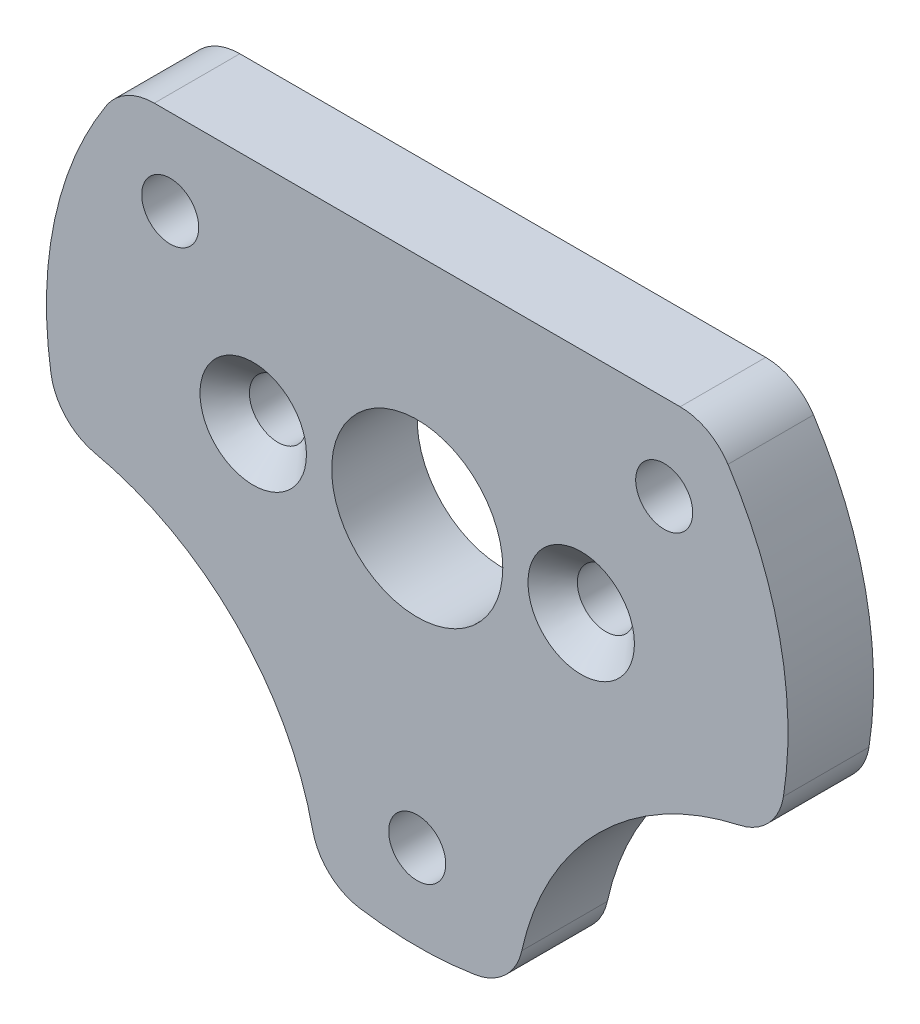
from build123d import *

# Parameters (mm, degrees)
SKETCH_1_R          = 1
SKETCH_1_R_2        = 3
EXTRUDE_1_DEPTH     = 3
CUT_EXTRUDE_START   = -10
CUT_EXTRUDE_1_DEPTH = 10
FILLET_1_R          = 2
CHAMFER_1_SIZE      = 0.866


with BuildPart() as part:
    # Sketch 1 → Extrude 1 (new body)
    with BuildSketch(Plane.XY):
        with BuildLine():
            Line((-10.246950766, 8), (10.246950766, 8))
            ThreePointArc((10.246950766, 8), (0, -13), (-10.246950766, 8))
        make_face()
        with Locations((0, -10)):
            Circle(SKETCH_1_R, mode=Mode.SUBTRACT)
        with Locations((-8.660254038, 5)):
            Circle(SKETCH_1_R, mode=Mode.SUBTRACT)
        with Locations((8.660254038, 5)):
            Circle(SKETCH_1_R, mode=Mode.SUBTRACT)
        with Locations((-5.75, 0)):
            Circle(SKETCH_1_R, mode=Mode.SUBTRACT)
        with Locations(Location((5.75, 0, 0), (0, 0, 180))):
            Circle(SKETCH_1_R, mode=Mode.SUBTRACT)
        Circle(SKETCH_1_R_2, mode=Mode.SUBTRACT)
    extrude(amount=EXTRUDE_1_DEPTH)

    # Sketch 2 → Cut-Extrude 1 (cut)
    with BuildSketch(Plane.XY.offset(3).offset(CUT_EXTRUDE_START)):
        with BuildLine():
            ThreePointArc((-12.526563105, -3.476379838), (-6.363961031, -6.363961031), (-3.476379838, -12.526563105))
            ThreePointArc((-3.476379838, -12.526563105), (-9.192388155, -9.192388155), (-12.526563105, -3.476379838))
        make_face()
        with BuildLine():
            ThreePointArc((12.526563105, -3.476379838), (6.363961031, -6.363961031), (3.476379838, -12.526563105))
            ThreePointArc((3.476379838, -12.526563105), (9.192388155, -9.192388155), (12.526563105, -3.476379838))
        make_face()
    extrude(amount=CUT_EXTRUDE_1_DEPTH, mode=Mode.SUBTRACT)

    # Fillet 1
    fillet_1_edges = [part.edges().sort_by_distance(p)[0] for p in [
        (-3.476379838, -12.526563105, 1.5),
        (-12.526563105, -3.476379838, 1.5),
        (-10.246950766, 8, 1.5),
        (12.526563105, -3.476379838, 1.5),
        (10.246950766, 8, 1.5),
        (3.476379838, -12.526563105, 1.5),
    ]]
    fillet(fillet_1_edges, radius=FILLET_1_R)

    # Chamfer 1
    chamfer_1_edges = [part.edges().sort_by_distance(p)[0] for p in [
        (-6.75, 0, 3),
        (6.75, 0, 3),
    ]]
    chamfer(chamfer_1_edges, length=CHAMFER_1_SIZE)


solid = part.part
